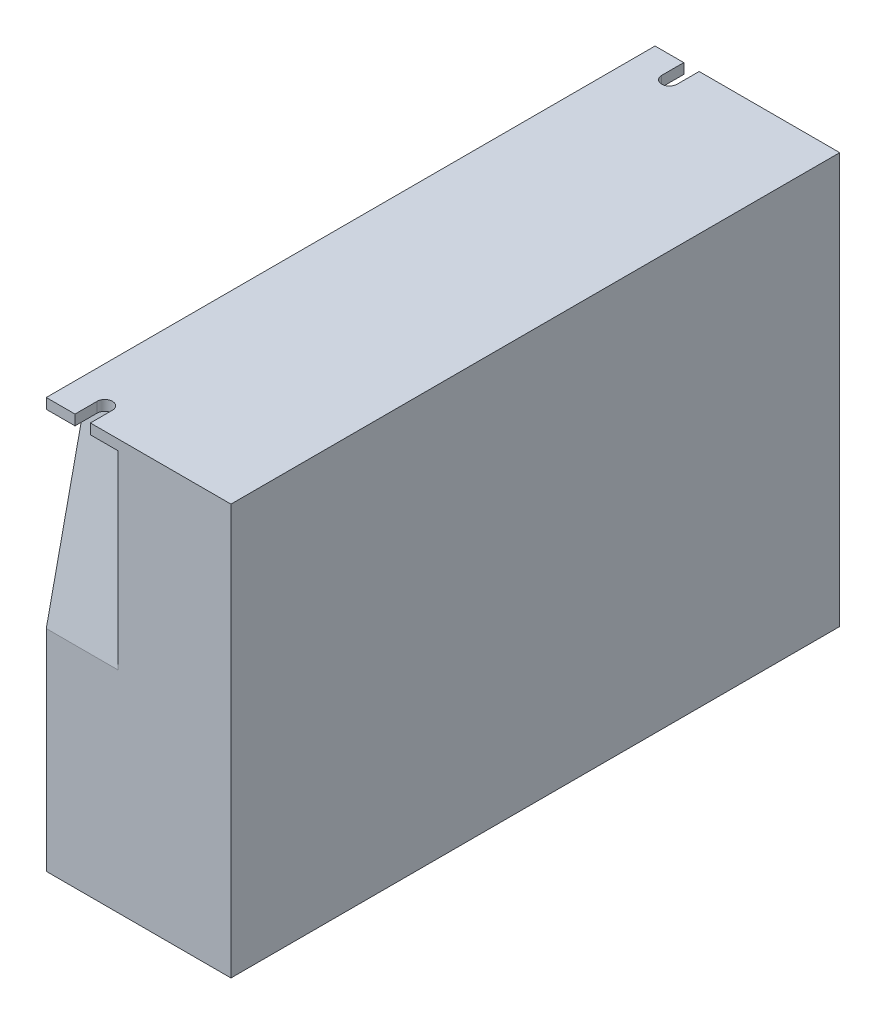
from build123d import *

# Parameters (mm, degrees)
SKETCH_1_W          = 178
SKETCH_1_H          = 120
EXTRUDE_1_DEPTH     = 54
CUT_EXTRUDE_1_DEPTH = 21
CUT_EXTRUDE_2_DEPTH = 3


with BuildPart() as part:
    # Sketch 1 → Extrude 1 (new body)
    with BuildSketch(Plane(origin=(0, 0, 0), x_dir=(0, 0, -1), z_dir=(1, 0, 0))):
        Rectangle(SKETCH_1_W, SKETCH_1_H)
    extrude(amount=EXTRUDE_1_DEPTH)

    # Sketch 2 → Cut-Extrude 1 (cut)
    with BuildSketch(Plane.ZY):
        Polygon((-89, 57), (-77, 57), (-89, 1.5), align=None)
        Polygon((89, 57), (89, 1.5), (77, 57), align=None)
    extrude(amount=-CUT_EXTRUDE_1_DEPTH, mode=Mode.SUBTRACT)

    # Sketch 3 → Cut-Extrude 2 (cut)
    with BuildSketch(Plane(origin=(0, 60, 0), x_dir=(1, 0, 0), z_dir=(0, 1, 0))):
        with BuildLine():
            Line((8.4, 82.55), (8.4, 89))
            Line((8.4, 89), (12.9, 89))
            Line((12.9, 89), (12.9, 82.55))
            ThreePointArc((12.9, 82.55), (10.65, 80.3), (8.4, 82.55))
        make_face()
        with BuildLine():
            Line((8.4, -82.55), (8.4, -89))
            Line((8.4, -89), (12.9, -89))
            Line((12.9, -89), (12.9, -82.55))
            ThreePointArc((12.9, -82.55), (10.65, -80.3), (8.4, -82.55))
        make_face()
    extrude(amount=-CUT_EXTRUDE_2_DEPTH, mode=Mode.SUBTRACT)


solid = part.part
